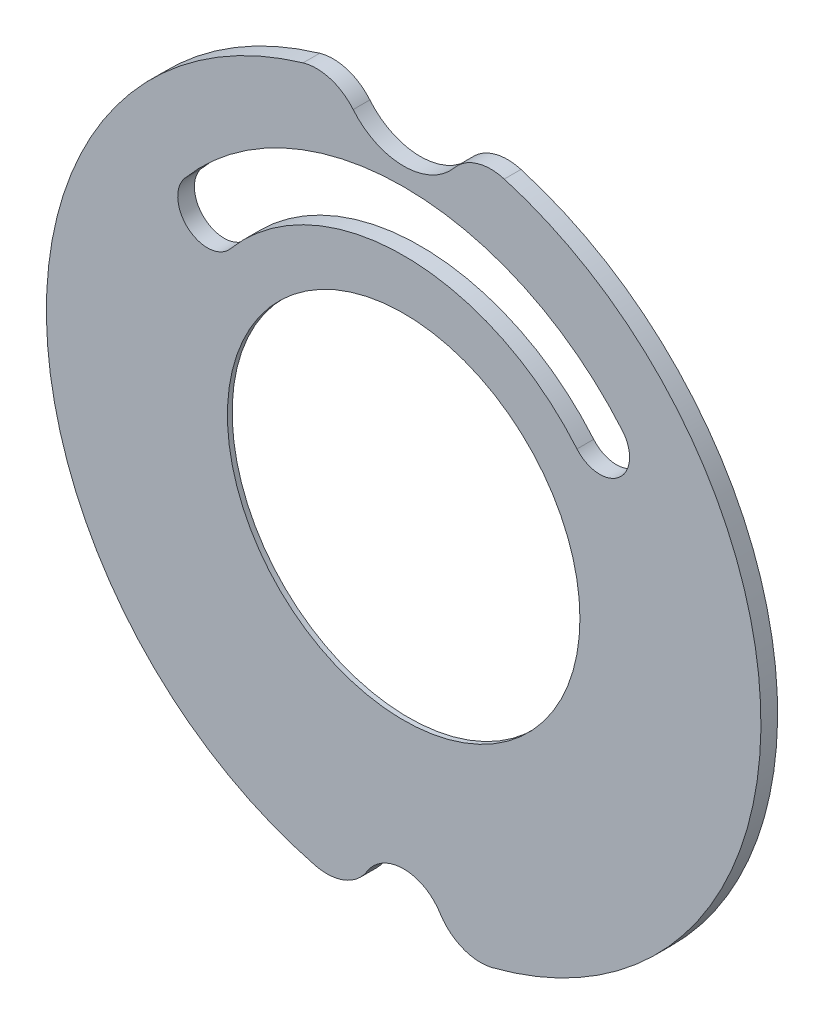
ISO-10303-21;
HEADER;
FILE_DESCRIPTION(('STEP AP214'),'2;1');
FILE_NAME('part.step','',(''),(''),'','','');
FILE_SCHEMA(('AUTOMOTIVE_DESIGN { 1 0 10303 214 1 1 1 1 }'));
ENDSEC;
DATA;
#1=APPLICATION_CONTEXT('core data for automotive mechanical design processes');
#2=APPLICATION_PROTOCOL_DEFINITION('international standard','automotive_design',2000,#1);
#3=PRODUCT_CONTEXT('',#1,'mechanical');
#4=PRODUCT('Part','Part','',(#3));
#5=PRODUCT_RELATED_PRODUCT_CATEGORY('part','',(#4));
#6=PRODUCT_DEFINITION_FORMATION('','',#4);
#7=PRODUCT_DEFINITION_CONTEXT('part definition',#1,'design');
#8=PRODUCT_DEFINITION('design','',#6,#7);
#9=PRODUCT_DEFINITION_SHAPE('','',#8);
#10=(LENGTH_UNIT() NAMED_UNIT(*) SI_UNIT(.MILLI.,.METRE.));
#11=(NAMED_UNIT(*) PLANE_ANGLE_UNIT() SI_UNIT($,.RADIAN.));
#12=(NAMED_UNIT(*) SI_UNIT($,.STERADIAN.) SOLID_ANGLE_UNIT());
#13=UNCERTAINTY_MEASURE_WITH_UNIT(LENGTH_MEASURE(1.E-05),#10,'distance_accuracy_value','');
#14=(GEOMETRIC_REPRESENTATION_CONTEXT(3) GLOBAL_UNCERTAINTY_ASSIGNED_CONTEXT((#13)) GLOBAL_UNIT_ASSIGNED_CONTEXT((#10,
#11,#12)) REPRESENTATION_CONTEXT('',''));
#15=CARTESIAN_POINT('',(0.,0.,0.));
#16=DIRECTION('',(0.,0.,1.));
#17=DIRECTION('',(1.,0.,0.));
#18=AXIS2_PLACEMENT_3D('',#15,#16,#17);
#19=CARTESIAN_POINT('',(0.,0.,0.));
#20=DIRECTION('',(0.,0.,1.));
#21=DIRECTION('',(1.,0.,0.));
#22=AXIS2_PLACEMENT_3D('',#19,#20,#21);
#23=PLANE('',#22);
#24=CARTESIAN_POINT('',(-82.3497776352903,69.0996680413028,0.));
#25=DIRECTION('',(0.,0.,1.));
#26=DIRECTION('',(1.,0.,0.));
#27=AXIS2_PLACEMENT_3D('',#24,#25,#26);
#28=CIRCLE('',#27,12.5);
#29=CARTESIAN_POINT('',(-91.9253331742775,77.1345131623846,0.));
#30=VERTEX_POINT('',#29);
#31=CARTESIAN_POINT('',(-72.774222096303,61.0648229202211,0.));
#32=VERTEX_POINT('',#31);
#33=EDGE_CURVE('E290',#30,#32,#28,.T.);
#34=ORIENTED_EDGE('',*,*,#33,.T.);
#35=CARTESIAN_POINT('',(0.,0.,0.));
#36=DIRECTION('',(0.,0.,-1.));
#37=DIRECTION('',(1.,0.,0.));
#38=AXIS2_PLACEMENT_3D('',#35,#36,#37);
#39=CIRCLE('',#38,95.);
#40=CARTESIAN_POINT('',(72.774222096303,61.0648229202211,0.));
#41=VERTEX_POINT('',#40);
#42=EDGE_CURVE('E293',#32,#41,#39,.T.);
#43=ORIENTED_EDGE('',*,*,#42,.T.);
#44=CARTESIAN_POINT('',(82.3497776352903,69.0996680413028,0.));
#45=DIRECTION('',(0.,0.,1.));
#46=DIRECTION('',(-1.,0.,0.));
#47=AXIS2_PLACEMENT_3D('',#44,#45,#46);
#48=CIRCLE('',#47,12.5);
#49=CARTESIAN_POINT('',(91.9253331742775,77.1345131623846,0.));
#50=VERTEX_POINT('',#49);
#51=EDGE_CURVE('E296',#41,#50,#48,.T.);
#52=ORIENTED_EDGE('',*,*,#51,.T.);
#53=CARTESIAN_POINT('',(0.,0.,0.));
#54=DIRECTION('',(0.,0.,1.));
#55=DIRECTION('',(1.,0.,0.));
#56=AXIS2_PLACEMENT_3D('',#53,#54,#55);
#57=CIRCLE('',#56,120.);
#58=EDGE_CURVE('E299',#50,#30,#57,.T.);
#59=ORIENTED_EDGE('',*,*,#58,.T.);
#60=EDGE_LOOP('',(#34,#43,#52,#59));
#61=FACE_BOUND('',#60,.T.);
#62=CARTESIAN_POINT('',(-82.3497776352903,69.0996680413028,0.));
#63=DIRECTION('',(0.,0.,1.));
#64=DIRECTION('',(1.,0.,0.));
#65=AXIS2_PLACEMENT_3D('',#62,#63,#64);
#66=CIRCLE('',#65,14.5);
#67=CARTESIAN_POINT('',(-93.4574220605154,78.4200883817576,0.));
#68=VERTEX_POINT('',#67);
#69=CARTESIAN_POINT('',(-71.242133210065,59.779247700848,0.));
#70=VERTEX_POINT('',#69);
#71=EDGE_CURVE('E259',#68,#70,#66,.T.);
#72=ORIENTED_EDGE('',*,*,#71,.F.);
#73=CARTESIAN_POINT('',(0.,0.,0.));
#74=DIRECTION('',(0.,0.,1.));
#75=DIRECTION('',(1.,0.,0.));
#76=AXIS2_PLACEMENT_3D('',#73,#74,#75);
#77=CIRCLE('',#76,122.);
#78=CARTESIAN_POINT('',(93.4574220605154,78.4200883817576,0.));
#79=VERTEX_POINT('',#78);
#80=EDGE_CURVE('E274',#79,#68,#77,.T.);
#81=ORIENTED_EDGE('',*,*,#80,.F.);
#82=CARTESIAN_POINT('',(82.3497776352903,69.0996680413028,0.));
#83=DIRECTION('',(0.,0.,1.));
#84=DIRECTION('',(1.,0.,0.));
#85=AXIS2_PLACEMENT_3D('',#82,#83,#84);
#86=CIRCLE('',#85,14.5);
#87=CARTESIAN_POINT('',(71.242133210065,59.779247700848,0.));
#88=VERTEX_POINT('',#87);
#89=EDGE_CURVE('E55',#88,#79,#86,.T.);
#90=ORIENTED_EDGE('',*,*,#89,.F.);
#91=CARTESIAN_POINT('',(0.,0.,0.));
#92=DIRECTION('',(0.,0.,1.));
#93=DIRECTION('',(1.,0.,0.));
#94=AXIS2_PLACEMENT_3D('',#91,#92,#93);
#95=CIRCLE('',#94,93.);
#96=EDGE_CURVE('E270',#70,#88,#95,.F.);
#97=ORIENTED_EDGE('',*,*,#96,.F.);
#98=EDGE_LOOP('',(#72,#81,#90,#97));
#99=FACE_BOUND('',#98,.T.);
#100=ADVANCED_FACE('F31',(#61,#99),#23,.F.);
#101=CARTESIAN_POINT('',(0.,0.,7.));
#102=DIRECTION('',(0.,0.,-1.));
#103=DIRECTION('',(-1.,0.,0.));
#104=AXIS2_PLACEMENT_3D('',#101,#102,#103);
#105=CYLINDRICAL_SURFACE('',#104,150.);
#106=CARTESIAN_POINT('',(0.,0.,0.));
#107=DIRECTION('',(0.,0.,1.));
#108=DIRECTION('',(1.,0.,0.));
#109=AXIS2_PLACEMENT_3D('',#106,#107,#108);
#110=CIRCLE('',#109,150.);
#111=CARTESIAN_POINT('',(-42.2448825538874,143.928349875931,0.));
#112=VERTEX_POINT('',#111);
#113=CARTESIAN_POINT('',(-37.232875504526,-145.305584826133,0.));
#114=VERTEX_POINT('',#113);
#115=EDGE_CURVE('E322',#112,#114,#110,.T.);
#116=ORIENTED_EDGE('',*,*,#115,.T.);
#117=DIRECTION('',(0.,0.,-1.));
#118=VECTOR('',#117,1.);
#119=CARTESIAN_POINT('',(-37.232875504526,-145.305584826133,7.));
#120=LINE('',#119,#118);
#121=CARTESIAN_POINT('',(-37.232875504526,-145.305584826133,7.));
#122=VERTEX_POINT('',#121);
#123=EDGE_CURVE('E11',#114,#122,#120,.F.);
#124=ORIENTED_EDGE('',*,*,#123,.T.);
#125=CARTESIAN_POINT('',(0.,0.,7.));
#126=DIRECTION('',(0.,0.,1.));
#127=DIRECTION('',(1.,0.,0.));
#128=AXIS2_PLACEMENT_3D('',#125,#126,#127);
#129=CIRCLE('',#128,150.);
#130=CARTESIAN_POINT('',(-42.2448825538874,143.928349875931,7.));
#131=VERTEX_POINT('',#130);
#132=EDGE_CURVE('E326',#131,#122,#129,.T.);
#133=ORIENTED_EDGE('',*,*,#132,.F.);
#134=DIRECTION('',(0.,0.,-1.));
#135=VECTOR('',#134,1.);
#136=CARTESIAN_POINT('',(-42.2448825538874,143.928349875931,7.));
#137=LINE('',#136,#135);
#138=EDGE_CURVE('E332',#131,#112,#137,.T.);
#139=ORIENTED_EDGE('',*,*,#138,.T.);
#140=EDGE_LOOP('',(#116,#124,#133,#139));
#141=FACE_BOUND('',#140,.T.);
#142=ADVANCED_FACE('F387',(#141),#105,.T.);
#143=CARTESIAN_POINT('',(0.,0.,7.));
#144=DIRECTION('',(0.,0.,1.));
#145=DIRECTION('',(1.,0.,0.));
#146=AXIS2_PLACEMENT_3D('',#143,#144,#145);
#147=PLANE('',#146);
#148=CARTESIAN_POINT('',(0.,0.,7.));
#149=DIRECTION('',(0.,0.,1.));
#150=DIRECTION('',(1.,0.,0.));
#151=AXIS2_PLACEMENT_3D('',#148,#149,#150);
#152=CIRCLE('',#151,74.);
#153=CARTESIAN_POINT('',(74.,0.,7.));
#154=VERTEX_POINT('',#153);
#155=EDGE_CURVE('E434',#154,#154,#152,.T.);
#156=ORIENTED_EDGE('',*,*,#155,.F.);
#157=EDGE_LOOP('',(#156));
#158=FACE_BOUND('',#157,.T.);
#159=CARTESIAN_POINT('',(0.,-146.,6.99999999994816));
#160=DIRECTION('',(0.,0.,1.));
#161=DIRECTION('',(1.,0.,0.));
#162=AXIS2_PLACEMENT_3D('',#159,#160,#161);
#163=CIRCLE('',#162,18.);
#164=CARTESIAN_POINT('',(15.2850752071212,-136.493871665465,6.99999999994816));
#165=VERTEX_POINT('',#164);
#166=CARTESIAN_POINT('',(-15.2850752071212,-136.493871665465,6.99999999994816));
#167=VERTEX_POINT('',#166);
#168=EDGE_CURVE('E278',#165,#167,#163,.T.);
#169=ORIENTED_EDGE('',*,*,#168,.F.);
#170=CARTESIAN_POINT('',(32.2684921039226,-125.931506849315,7.));
#171=DIRECTION('',(0.,0.,1.));
#172=DIRECTION('',(1.,0.,0.));
#173=AXIS2_PLACEMENT_3D('',#170,#171,#172);
#174=CIRCLE('',#173,20.);
#175=CARTESIAN_POINT('',(37.232875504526,-145.305584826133,7.));
#176=VERTEX_POINT('',#175);
#177=EDGE_CURVE('E40',#165,#176,#174,.T.);
#178=ORIENTED_EDGE('',*,*,#177,.T.);
#179=CARTESIAN_POINT('',(42.2448825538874,143.928349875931,7.));
#180=VERTEX_POINT('',#179);
#181=EDGE_CURVE('E325',#176,#180,#129,.T.);
#182=ORIENTED_EDGE('',*,*,#181,.T.);
#183=CARTESIAN_POINT('',(36.6122315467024,124.737903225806,7.));
#184=DIRECTION('',(0.,0.,1.));
#185=DIRECTION('',(1.,0.,0.));
#186=AXIS2_PLACEMENT_3D('',#183,#184,#185);
#187=CIRCLE('',#186,20.);
#188=CARTESIAN_POINT('',(21.1965551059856,137.479838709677,7.000000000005));
#189=VERTEX_POINT('',#188);
#190=EDGE_CURVE('E344',#180,#189,#187,.T.);
#191=ORIENTED_EDGE('',*,*,#190,.T.);
#192=CARTESIAN_POINT('',(0.,155.,7.000000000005));
#193=DIRECTION('',(0.,0.,1.));
#194=DIRECTION('',(1.,0.,0.));
#195=AXIS2_PLACEMENT_3D('',#192,#193,#194);
#196=CIRCLE('',#195,27.5);
#197=CARTESIAN_POINT('',(-21.1965551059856,137.479838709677,7.000000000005));
#198=VERTEX_POINT('',#197);
#199=EDGE_CURVE('E284',#198,#189,#196,.T.);
#200=ORIENTED_EDGE('',*,*,#199,.F.);
#201=CARTESIAN_POINT('',(-36.6122315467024,124.737903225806,7.));
#202=DIRECTION('',(0.,0.,1.));
#203=DIRECTION('',(1.,0.,0.));
#204=AXIS2_PLACEMENT_3D('',#201,#202,#203);
#205=CIRCLE('',#204,20.);
#206=EDGE_CURVE('E346',#198,#131,#205,.T.);
#207=ORIENTED_EDGE('',*,*,#206,.T.);
#208=ORIENTED_EDGE('',*,*,#132,.T.);
#209=CARTESIAN_POINT('',(-32.2684921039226,-125.931506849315,7.));
#210=DIRECTION('',(0.,0.,1.));
#211=DIRECTION('',(1.,0.,0.));
#212=AXIS2_PLACEMENT_3D('',#209,#210,#211);
#213=CIRCLE('',#212,20.);
#214=EDGE_CURVE('E359',#122,#167,#213,.T.);
#215=ORIENTED_EDGE('',*,*,#214,.T.);
#216=EDGE_LOOP('',(#169,#178,#182,#191,#200,#207,#208,#215));
#217=FACE_BOUND('',#216,.T.);
#218=CARTESIAN_POINT('',(0.,0.,7.));
#219=DIRECTION('',(0.,0.,-1.));
#220=DIRECTION('',(1.,0.,0.));
#221=AXIS2_PLACEMENT_3D('',#218,#219,#220);
#222=CIRCLE('',#221,95.);
#223=CARTESIAN_POINT('',(-72.774222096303,61.0648229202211,7.));
#224=VERTEX_POINT('',#223);
#225=CARTESIAN_POINT('',(72.774222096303,61.0648229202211,7.));
#226=VERTEX_POINT('',#225);
#227=EDGE_CURVE('E304',#224,#226,#222,.T.);
#228=ORIENTED_EDGE('',*,*,#227,.F.);
#229=CARTESIAN_POINT('',(-82.3497776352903,69.0996680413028,7.));
#230=DIRECTION('',(0.,0.,1.));
#231=DIRECTION('',(1.,0.,0.));
#232=AXIS2_PLACEMENT_3D('',#229,#230,#231);
#233=CIRCLE('',#232,12.5);
#234=CARTESIAN_POINT('',(-91.9253331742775,77.1345131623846,7.));
#235=VERTEX_POINT('',#234);
#236=EDGE_CURVE('E302',#235,#224,#233,.T.);
#237=ORIENTED_EDGE('',*,*,#236,.F.);
#238=CARTESIAN_POINT('',(0.,0.,7.));
#239=DIRECTION('',(0.,0.,1.));
#240=DIRECTION('',(1.,0.,0.));
#241=AXIS2_PLACEMENT_3D('',#238,#239,#240);
#242=CIRCLE('',#241,120.);
#243=CARTESIAN_POINT('',(91.9253331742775,77.1345131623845,7.));
#244=VERTEX_POINT('',#243);
#245=EDGE_CURVE('E309',#244,#235,#242,.T.);
#246=ORIENTED_EDGE('',*,*,#245,.F.);
#247=CARTESIAN_POINT('',(82.3497776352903,69.0996680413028,7.));
#248=DIRECTION('',(0.,0.,1.));
#249=DIRECTION('',(-1.,0.,0.));
#250=AXIS2_PLACEMENT_3D('',#247,#248,#249);
#251=CIRCLE('',#250,12.5);
#252=EDGE_CURVE('E306',#226,#244,#251,.T.);
#253=ORIENTED_EDGE('',*,*,#252,.F.);
#254=EDGE_LOOP('',(#228,#237,#246,#253));
#255=FACE_BOUND('',#254,.T.);
#256=ADVANCED_FACE('F365',(#158,#217,#255),#147,.T.);
#257=CARTESIAN_POINT('',(32.2684921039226,-125.931506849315,0.));
#258=DIRECTION('',(0.,0.,1.));
#259=DIRECTION('',(1.,0.,0.));
#260=AXIS2_PLACEMENT_3D('',#257,#258,#259);
#261=CIRCLE('',#260,18.);
#262=CARTESIAN_POINT('',(36.7364371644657,-143.368177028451,0.));
#263=VERTEX_POINT('',#262);
#264=CARTESIAN_POINT('',(16.9834168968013,-135.43763518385,0.));
#265=VERTEX_POINT('',#264);
#266=EDGE_CURVE('E227',#263,#265,#261,.F.);
#267=ORIENTED_EDGE('',*,*,#266,.F.);
#268=CARTESIAN_POINT('',(0.,0.,0.));
#269=DIRECTION('',(0.,0.,1.));
#270=DIRECTION('',(1.,0.,0.));
#271=AXIS2_PLACEMENT_3D('',#268,#269,#270);
#272=CIRCLE('',#271,148.);
#273=CARTESIAN_POINT('',(41.6816174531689,142.009305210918,0.));
#274=VERTEX_POINT('',#273);
#275=EDGE_CURVE('E222',#263,#274,#272,.T.);
#276=ORIENTED_EDGE('',*,*,#275,.T.);
#277=CARTESIAN_POINT('',(36.6122315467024,124.737903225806,0.));
#278=DIRECTION('',(0.,0.,1.));
#279=DIRECTION('',(1.,0.,0.));
#280=AXIS2_PLACEMENT_3D('',#277,#278,#279);
#281=CIRCLE('',#280,18.);
#282=CARTESIAN_POINT('',(22.7381227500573,136.20564516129,0.));
#283=VERTEX_POINT('',#282);
#284=EDGE_CURVE('E257',#283,#274,#281,.F.);
#285=ORIENTED_EDGE('',*,*,#284,.F.);
#286=CARTESIAN_POINT('',(0.,155.,0.));
#287=DIRECTION('',(0.,0.,1.));
#288=DIRECTION('',(1.,0.,0.));
#289=AXIS2_PLACEMENT_3D('',#286,#287,#288);
#290=CIRCLE('',#289,29.5);
#291=CARTESIAN_POINT('',(-22.7381227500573,136.20564516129,0.));
#292=VERTEX_POINT('',#291);
#293=EDGE_CURVE('E47',#292,#283,#290,.T.);
#294=ORIENTED_EDGE('',*,*,#293,.F.);
#295=CARTESIAN_POINT('',(-36.6122315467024,124.737903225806,0.));
#296=DIRECTION('',(0.,0.,1.));
#297=DIRECTION('',(1.,0.,0.));
#298=AXIS2_PLACEMENT_3D('',#295,#296,#297);
#299=CIRCLE('',#298,18.);
#300=CARTESIAN_POINT('',(-41.6816174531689,142.009305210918,0.));
#301=VERTEX_POINT('',#300);
#302=EDGE_CURVE('E240',#301,#292,#299,.F.);
#303=ORIENTED_EDGE('',*,*,#302,.F.);
#304=CARTESIAN_POINT('',(0.,0.,0.));
#305=DIRECTION('',(0.,0.,1.));
#306=DIRECTION('',(1.,0.,0.));
#307=AXIS2_PLACEMENT_3D('',#304,#305,#306);
#308=CIRCLE('',#307,148.);
#309=CARTESIAN_POINT('',(-36.7364371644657,-143.368177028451,0.));
#310=VERTEX_POINT('',#309);
#311=EDGE_CURVE('E218',#301,#310,#308,.T.);
#312=ORIENTED_EDGE('',*,*,#311,.T.);
#313=CARTESIAN_POINT('',(-32.2684921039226,-125.931506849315,0.));
#314=DIRECTION('',(0.,0.,1.));
#315=DIRECTION('',(1.,0.,0.));
#316=AXIS2_PLACEMENT_3D('',#313,#314,#315);
#317=CIRCLE('',#316,18.);
#318=CARTESIAN_POINT('',(-16.9834168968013,-135.43763518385,0.));
#319=VERTEX_POINT('',#318);
#320=EDGE_CURVE('E224',#319,#310,#317,.F.);
#321=ORIENTED_EDGE('',*,*,#320,.F.);
#322=CARTESIAN_POINT('',(0.,-146.,0.));
#323=DIRECTION('',(0.,0.,1.));
#324=DIRECTION('',(1.,0.,0.));
#325=AXIS2_PLACEMENT_3D('',#322,#323,#324);
#326=CIRCLE('',#325,20.);
#327=EDGE_CURVE('E264',#265,#319,#326,.T.);
#328=ORIENTED_EDGE('',*,*,#327,.F.);
#329=EDGE_LOOP('',(#267,#276,#285,#294,#303,#312,#321,#328));
#330=FACE_BOUND('',#329,.T.);
#331=CARTESIAN_POINT('',(37.232875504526,-145.305584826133,0.));
#332=VERTEX_POINT('',#331);
#333=CARTESIAN_POINT('',(42.2448825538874,143.928349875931,0.));
#334=VERTEX_POINT('',#333);
#335=EDGE_CURVE('E321',#332,#334,#110,.T.);
#336=ORIENTED_EDGE('',*,*,#335,.F.);
#337=CARTESIAN_POINT('',(32.2684921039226,-125.931506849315,0.));
#338=DIRECTION('',(0.,0.,1.));
#339=DIRECTION('',(1.,0.,0.));
#340=AXIS2_PLACEMENT_3D('',#337,#338,#339);
#341=CIRCLE('',#340,20.);
#342=CARTESIAN_POINT('',(15.2850752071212,-136.493871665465,0.));
#343=VERTEX_POINT('',#342);
#344=EDGE_CURVE('E353',#332,#343,#341,.F.);
#345=ORIENTED_EDGE('',*,*,#344,.T.);
#346=CARTESIAN_POINT('',(0.,-146.,0.));
#347=DIRECTION('',(0.,0.,1.));
#348=DIRECTION('',(1.,0.,0.));
#349=AXIS2_PLACEMENT_3D('',#346,#347,#348);
#350=CIRCLE('',#349,18.);
#351=CARTESIAN_POINT('',(-15.2850752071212,-136.493871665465,0.));
#352=VERTEX_POINT('',#351);
#353=EDGE_CURVE('E281',#343,#352,#350,.T.);
#354=ORIENTED_EDGE('',*,*,#353,.T.);
#355=CARTESIAN_POINT('',(-32.2684921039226,-125.931506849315,0.));
#356=DIRECTION('',(0.,0.,1.));
#357=DIRECTION('',(1.,0.,0.));
#358=AXIS2_PLACEMENT_3D('',#355,#356,#357);
#359=CIRCLE('',#358,20.);
#360=EDGE_CURVE('E351',#352,#114,#359,.F.);
#361=ORIENTED_EDGE('',*,*,#360,.T.);
#362=ORIENTED_EDGE('',*,*,#115,.F.);
#363=CARTESIAN_POINT('',(-36.6122315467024,124.737903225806,0.));
#364=DIRECTION('',(0.,0.,1.));
#365=DIRECTION('',(1.,0.,0.));
#366=AXIS2_PLACEMENT_3D('',#363,#364,#365);
#367=CIRCLE('',#366,20.);
#368=CARTESIAN_POINT('',(-21.1965551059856,137.479838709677,0.));
#369=VERTEX_POINT('',#368);
#370=EDGE_CURVE('E338',#112,#369,#367,.F.);
#371=ORIENTED_EDGE('',*,*,#370,.T.);
#372=CARTESIAN_POINT('',(0.,155.,0.));
#373=DIRECTION('',(0.,0.,1.));
#374=DIRECTION('',(1.,0.,0.));
#375=AXIS2_PLACEMENT_3D('',#372,#373,#374);
#376=CIRCLE('',#375,27.5);
#377=CARTESIAN_POINT('',(21.1965551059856,137.479838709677,0.));
#378=VERTEX_POINT('',#377);
#379=EDGE_CURVE('E287',#369,#378,#376,.T.);
#380=ORIENTED_EDGE('',*,*,#379,.T.);
#381=CARTESIAN_POINT('',(36.6122315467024,124.737903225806,0.));
#382=DIRECTION('',(0.,0.,1.));
#383=DIRECTION('',(1.,0.,0.));
#384=AXIS2_PLACEMENT_3D('',#381,#382,#383);
#385=CIRCLE('',#384,20.);
#386=EDGE_CURVE('E335',#378,#334,#385,.F.);
#387=ORIENTED_EDGE('',*,*,#386,.T.);
#388=EDGE_LOOP('',(#336,#345,#354,#361,#362,#371,#380,#387));
#389=FACE_BOUND('',#388,.T.);
#390=ADVANCED_FACE('F377',(#330,#389),#23,.F.);
#391=ORIENTED_EDGE('',*,*,#181,.F.);
#392=DIRECTION('',(0.,0.,-1.));
#393=VECTOR('',#392,1.);
#394=CARTESIAN_POINT('',(37.232875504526,-145.305584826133,7.));
#395=LINE('',#394,#393);
#396=EDGE_CURVE('E348',#176,#332,#395,.T.);
#397=ORIENTED_EDGE('',*,*,#396,.T.);
#398=ORIENTED_EDGE('',*,*,#335,.T.);
#399=DIRECTION('',(0.,0.,-1.));
#400=VECTOR('',#399,1.);
#401=CARTESIAN_POINT('',(42.2448825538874,143.928349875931,7.));
#402=LINE('',#401,#400);
#403=EDGE_CURVE('E329',#334,#180,#402,.F.);
#404=ORIENTED_EDGE('',*,*,#403,.T.);
#405=EDGE_LOOP('',(#391,#397,#398,#404));
#406=FACE_BOUND('',#405,.T.);
#407=ADVANCED_FACE('F33',(#406),#105,.T.);
#408=CARTESIAN_POINT('',(-82.3497776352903,69.0996680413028,7.));
#409=DIRECTION('',(0.,0.,-1.));
#410=DIRECTION('',(-1.,0.,0.));
#411=AXIS2_PLACEMENT_3D('',#408,#409,#410);
#412=CYLINDRICAL_SURFACE('',#411,12.5);
#413=ORIENTED_EDGE('',*,*,#33,.F.);
#414=DIRECTION('',(0.,0.,-1.));
#415=VECTOR('',#414,1.);
#416=CARTESIAN_POINT('',(-91.9253331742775,77.1345131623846,7.));
#417=LINE('',#416,#415);
#418=EDGE_CURVE('E311',#235,#30,#417,.T.);
#419=ORIENTED_EDGE('',*,*,#418,.F.);
#420=ORIENTED_EDGE('',*,*,#236,.T.);
#421=DIRECTION('',(0.,0.,-1.));
#422=VECTOR('',#421,1.);
#423=CARTESIAN_POINT('',(-72.774222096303,61.0648229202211,7.));
#424=LINE('',#423,#422);
#425=EDGE_CURVE('E318',#224,#32,#424,.T.);
#426=ORIENTED_EDGE('',*,*,#425,.T.);
#427=EDGE_LOOP('',(#413,#419,#420,#426));
#428=FACE_BOUND('',#427,.T.);
#429=ADVANCED_FACE('F424',(#428),#412,.F.);
#430=CARTESIAN_POINT('',(0.,0.,7.));
#431=DIRECTION('',(0.,0.,-1.));
#432=DIRECTION('',(-1.,0.,0.));
#433=AXIS2_PLACEMENT_3D('',#430,#431,#432);
#434=CYLINDRICAL_SURFACE('',#433,95.);
#435=ORIENTED_EDGE('',*,*,#42,.F.);
#436=ORIENTED_EDGE('',*,*,#425,.F.);
#437=ORIENTED_EDGE('',*,*,#227,.T.);
#438=DIRECTION('',(0.,0.,-1.));
#439=VECTOR('',#438,1.);
#440=CARTESIAN_POINT('',(72.774222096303,61.0648229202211,7.));
#441=LINE('',#440,#439);
#442=EDGE_CURVE('E316',#226,#41,#441,.T.);
#443=ORIENTED_EDGE('',*,*,#442,.T.);
#444=EDGE_LOOP('',(#435,#436,#437,#443));
#445=FACE_BOUND('',#444,.T.);
#446=ADVANCED_FACE('F634',(#445),#434,.T.);
#447=CARTESIAN_POINT('',(82.3497776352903,69.0996680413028,7.));
#448=DIRECTION('',(0.,0.,-1.));
#449=DIRECTION('',(-1.,0.,0.));
#450=AXIS2_PLACEMENT_3D('',#447,#448,#449);
#451=CYLINDRICAL_SURFACE('',#450,12.5);
#452=ORIENTED_EDGE('',*,*,#51,.F.);
#453=ORIENTED_EDGE('',*,*,#442,.F.);
#454=ORIENTED_EDGE('',*,*,#252,.T.);
#455=DIRECTION('',(0.,0.,-1.));
#456=VECTOR('',#455,1.);
#457=CARTESIAN_POINT('',(91.9253331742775,77.1345131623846,7.));
#458=LINE('',#457,#456);
#459=EDGE_CURVE('E314',#244,#50,#458,.T.);
#460=ORIENTED_EDGE('',*,*,#459,.T.);
#461=EDGE_LOOP('',(#452,#453,#454,#460));
#462=FACE_BOUND('',#461,.T.);
#463=ADVANCED_FACE('F640',(#462),#451,.F.);
#464=CARTESIAN_POINT('',(0.,0.,7.));
#465=DIRECTION('',(0.,0.,-1.));
#466=DIRECTION('',(-1.,0.,0.));
#467=AXIS2_PLACEMENT_3D('',#464,#465,#466);
#468=CYLINDRICAL_SURFACE('',#467,120.);
#469=ORIENTED_EDGE('',*,*,#58,.F.);
#470=ORIENTED_EDGE('',*,*,#459,.F.);
#471=ORIENTED_EDGE('',*,*,#245,.T.);
#472=ORIENTED_EDGE('',*,*,#418,.T.);
#473=EDGE_LOOP('',(#469,#470,#471,#472));
#474=FACE_BOUND('',#473,.T.);
#475=ADVANCED_FACE('F648',(#474),#468,.F.);
#476=CARTESIAN_POINT('',(0.,155.,0.));
#477=DIRECTION('',(0.,0.,1.));
#478=DIRECTION('',(1.,0.,0.));
#479=AXIS2_PLACEMENT_3D('',#476,#477,#478);
#480=CYLINDRICAL_SURFACE('',#479,27.5);
#481=ORIENTED_EDGE('',*,*,#379,.F.);
#482=DIRECTION('',(0.,0.,1.));
#483=VECTOR('',#482,1.);
#484=CARTESIAN_POINT('',(-21.1965551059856,137.479838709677,0.));
#485=LINE('',#484,#483);
#486=EDGE_CURVE('E342',#369,#198,#485,.T.);
#487=ORIENTED_EDGE('',*,*,#486,.T.);
#488=ORIENTED_EDGE('',*,*,#199,.T.);
#489=DIRECTION('',(0.,0.,1.));
#490=VECTOR('',#489,1.);
#491=CARTESIAN_POINT('',(21.1965551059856,137.479838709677,0.));
#492=LINE('',#491,#490);
#493=EDGE_CURVE('E340',#189,#378,#492,.F.);
#494=ORIENTED_EDGE('',*,*,#493,.T.);
#495=EDGE_LOOP('',(#481,#487,#488,#494));
#496=FACE_BOUND('',#495,.T.);
#497=ADVANCED_FACE('F397',(#496),#480,.F.);
#498=CARTESIAN_POINT('',(-36.6122315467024,124.737903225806,0.));
#499=DIRECTION('',(0.,0.,1.));
#500=DIRECTION('',(1.,0.,0.));
#501=AXIS2_PLACEMENT_3D('',#498,#499,#500);
#502=CYLINDRICAL_SURFACE('',#501,20.);
#503=ORIENTED_EDGE('',*,*,#206,.F.);
#504=ORIENTED_EDGE('',*,*,#486,.F.);
#505=ORIENTED_EDGE('',*,*,#370,.F.);
#506=ORIENTED_EDGE('',*,*,#138,.F.);
#507=EDGE_LOOP('',(#503,#504,#505,#506));
#508=FACE_BOUND('',#507,.T.);
#509=ADVANCED_FACE('F392',(#508),#502,.T.);
#510=CARTESIAN_POINT('',(36.6122315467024,124.737903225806,0.));
#511=DIRECTION('',(0.,0.,-1.));
#512=DIRECTION('',(-1.,0.,0.));
#513=AXIS2_PLACEMENT_3D('',#510,#511,#512);
#514=CYLINDRICAL_SURFACE('',#513,20.);
#515=ORIENTED_EDGE('',*,*,#386,.F.);
#516=ORIENTED_EDGE('',*,*,#493,.F.);
#517=ORIENTED_EDGE('',*,*,#190,.F.);
#518=ORIENTED_EDGE('',*,*,#403,.F.);
#519=EDGE_LOOP('',(#515,#516,#517,#518));
#520=FACE_BOUND('',#519,.T.);
#521=ADVANCED_FACE('F401',(#520),#514,.T.);
#522=CARTESIAN_POINT('',(0.,-146.,0.));
#523=DIRECTION('',(0.,0.,1.));
#524=DIRECTION('',(1.,0.,0.));
#525=AXIS2_PLACEMENT_3D('',#522,#523,#524);
#526=CYLINDRICAL_SURFACE('',#525,18.);
#527=ORIENTED_EDGE('',*,*,#353,.F.);
#528=DIRECTION('',(0.,0.,1.));
#529=VECTOR('',#528,1.);
#530=CARTESIAN_POINT('',(15.2850752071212,-136.493871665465,0.));
#531=LINE('',#530,#529);
#532=EDGE_CURVE('E357',#343,#165,#531,.T.);
#533=ORIENTED_EDGE('',*,*,#532,.T.);
#534=ORIENTED_EDGE('',*,*,#168,.T.);
#535=DIRECTION('',(0.,0.,1.));
#536=VECTOR('',#535,1.);
#537=CARTESIAN_POINT('',(-15.2850752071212,-136.493871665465,0.));
#538=LINE('',#537,#536);
#539=EDGE_CURVE('E355',#167,#352,#538,.F.);
#540=ORIENTED_EDGE('',*,*,#539,.T.);
#541=EDGE_LOOP('',(#527,#533,#534,#540));
#542=FACE_BOUND('',#541,.T.);
#543=ADVANCED_FACE('F380',(#542),#526,.F.);
#544=CARTESIAN_POINT('',(32.2684921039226,-125.931506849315,0.));
#545=DIRECTION('',(0.,0.,1.));
#546=DIRECTION('',(1.,0.,0.));
#547=AXIS2_PLACEMENT_3D('',#544,#545,#546);
#548=CYLINDRICAL_SURFACE('',#547,20.);
#549=ORIENTED_EDGE('',*,*,#177,.F.);
#550=ORIENTED_EDGE('',*,*,#532,.F.);
#551=ORIENTED_EDGE('',*,*,#344,.F.);
#552=ORIENTED_EDGE('',*,*,#396,.F.);
#553=EDGE_LOOP('',(#549,#550,#551,#552));
#554=FACE_BOUND('',#553,.T.);
#555=ADVANCED_FACE('F374',(#554),#548,.T.);
#556=CARTESIAN_POINT('',(-32.2684921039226,-125.931506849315,0.));
#557=DIRECTION('',(0.,0.,-1.));
#558=DIRECTION('',(-1.,0.,0.));
#559=AXIS2_PLACEMENT_3D('',#556,#557,#558);
#560=CYLINDRICAL_SURFACE('',#559,20.);
#561=ORIENTED_EDGE('',*,*,#360,.F.);
#562=ORIENTED_EDGE('',*,*,#539,.F.);
#563=ORIENTED_EDGE('',*,*,#214,.F.);
#564=ORIENTED_EDGE('',*,*,#123,.F.);
#565=EDGE_LOOP('',(#561,#562,#563,#564));
#566=FACE_BOUND('',#565,.T.);
#567=ADVANCED_FACE('F383',(#566),#560,.T.);
#568=CARTESIAN_POINT('',(0.,0.,7.));
#569=DIRECTION('',(0.,0.,-1.));
#570=DIRECTION('',(-1.,0.,0.));
#571=AXIS2_PLACEMENT_3D('',#568,#569,#570);
#572=CYLINDRICAL_SURFACE('',#571,148.);
#573=ORIENTED_EDGE('',*,*,#311,.F.);
#574=DIRECTION('',(0.,0.,-1.));
#575=VECTOR('',#574,1.);
#576=CARTESIAN_POINT('',(-41.6816174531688,142.009305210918,7.));
#577=LINE('',#576,#575);
#578=CARTESIAN_POINT('',(-41.6816174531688,142.009305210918,5.));
#579=VERTEX_POINT('',#578);
#580=EDGE_CURVE('E236',#579,#301,#577,.T.);
#581=ORIENTED_EDGE('',*,*,#580,.F.);
#582=CARTESIAN_POINT('',(0.,0.,5.));
#583=DIRECTION('',(0.,0.,1.));
#584=DIRECTION('',(1.,0.,0.));
#585=AXIS2_PLACEMENT_3D('',#582,#583,#584);
#586=CIRCLE('',#585,148.);
#587=CARTESIAN_POINT('',(-36.7364371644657,-143.368177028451,5.));
#588=VERTEX_POINT('',#587);
#589=EDGE_CURVE('E217',#579,#588,#586,.T.);
#590=ORIENTED_EDGE('',*,*,#589,.T.);
#591=DIRECTION('',(0.,0.,-1.));
#592=VECTOR('',#591,1.);
#593=CARTESIAN_POINT('',(-36.7364371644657,-143.368177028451,7.));
#594=LINE('',#593,#592);
#595=EDGE_CURVE('E205',#310,#588,#594,.F.);
#596=ORIENTED_EDGE('',*,*,#595,.F.);
#597=EDGE_LOOP('',(#573,#581,#590,#596));
#598=FACE_BOUND('',#597,.T.);
#599=ADVANCED_FACE('F493',(#598),#572,.F.);
#600=CARTESIAN_POINT('',(0.,0.,5.));
#601=DIRECTION('',(0.,0.,1.));
#602=DIRECTION('',(1.,0.,0.));
#603=AXIS2_PLACEMENT_3D('',#600,#601,#602);
#604=PLANE('',#603);
#605=CARTESIAN_POINT('',(0.,0.,5.));
#606=DIRECTION('',(0.,0.,1.));
#607=DIRECTION('',(1.,0.,0.));
#608=AXIS2_PLACEMENT_3D('',#605,#606,#607);
#609=CIRCLE('',#608,74.);
#610=CARTESIAN_POINT('',(74.,0.,5.));
#611=VERTEX_POINT('',#610);
#612=EDGE_CURVE('E35',#611,#611,#609,.T.);
#613=ORIENTED_EDGE('',*,*,#612,.T.);
#614=EDGE_LOOP('',(#613));
#615=FACE_BOUND('',#614,.T.);
#616=CARTESIAN_POINT('',(0.,-146.,5.));
#617=DIRECTION('',(0.,0.,1.));
#618=DIRECTION('',(1.,0.,0.));
#619=AXIS2_PLACEMENT_3D('',#616,#617,#618);
#620=CIRCLE('',#619,20.);
#621=CARTESIAN_POINT('',(16.9834168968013,-135.43763518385,5.));
#622=VERTEX_POINT('',#621);
#623=CARTESIAN_POINT('',(-16.9834168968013,-135.43763518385,5.));
#624=VERTEX_POINT('',#623);
#625=EDGE_CURVE('E266',#622,#624,#620,.T.);
#626=ORIENTED_EDGE('',*,*,#625,.T.);
#627=CARTESIAN_POINT('',(-32.2684921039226,-125.931506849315,5.));
#628=DIRECTION('',(0.,0.,1.));
#629=DIRECTION('',(1.,0.,0.));
#630=AXIS2_PLACEMENT_3D('',#627,#628,#629);
#631=CIRCLE('',#630,18.);
#632=EDGE_CURVE('E206',#588,#624,#631,.T.);
#633=ORIENTED_EDGE('',*,*,#632,.F.);
#634=ORIENTED_EDGE('',*,*,#589,.F.);
#635=CARTESIAN_POINT('',(-36.6122315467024,124.737903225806,5.));
#636=DIRECTION('',(0.,0.,1.));
#637=DIRECTION('',(1.,0.,0.));
#638=AXIS2_PLACEMENT_3D('',#635,#636,#637);
#639=CIRCLE('',#638,18.);
#640=CARTESIAN_POINT('',(-22.7381227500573,136.20564516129,5.));
#641=VERTEX_POINT('',#640);
#642=EDGE_CURVE('E225',#641,#579,#639,.T.);
#643=ORIENTED_EDGE('',*,*,#642,.F.);
#644=CARTESIAN_POINT('',(0.,155.,5.));
#645=DIRECTION('',(0.,0.,1.));
#646=DIRECTION('',(1.,0.,0.));
#647=AXIS2_PLACEMENT_3D('',#644,#645,#646);
#648=CIRCLE('',#647,29.5);
#649=CARTESIAN_POINT('',(22.7381227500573,136.20564516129,5.));
#650=VERTEX_POINT('',#649);
#651=EDGE_CURVE('E260',#641,#650,#648,.T.);
#652=ORIENTED_EDGE('',*,*,#651,.T.);
#653=CARTESIAN_POINT('',(36.6122315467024,124.737903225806,5.));
#654=DIRECTION('',(0.,0.,1.));
#655=DIRECTION('',(1.,0.,0.));
#656=AXIS2_PLACEMENT_3D('',#653,#654,#655);
#657=CIRCLE('',#656,18.);
#658=CARTESIAN_POINT('',(41.6816174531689,142.009305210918,5.));
#659=VERTEX_POINT('',#658);
#660=EDGE_CURVE('E213',#659,#650,#657,.T.);
#661=ORIENTED_EDGE('',*,*,#660,.F.);
#662=CARTESIAN_POINT('',(0.,0.,5.));
#663=DIRECTION('',(0.,0.,1.));
#664=DIRECTION('',(1.,0.,0.));
#665=AXIS2_PLACEMENT_3D('',#662,#663,#664);
#666=CIRCLE('',#665,148.);
#667=CARTESIAN_POINT('',(36.7364371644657,-143.368177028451,5.));
#668=VERTEX_POINT('',#667);
#669=EDGE_CURVE('E209',#668,#659,#666,.T.);
#670=ORIENTED_EDGE('',*,*,#669,.F.);
#671=CARTESIAN_POINT('',(32.2684921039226,-125.931506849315,5.));
#672=DIRECTION('',(0.,0.,1.));
#673=DIRECTION('',(1.,0.,0.));
#674=AXIS2_PLACEMENT_3D('',#671,#672,#673);
#675=CIRCLE('',#674,18.);
#676=EDGE_CURVE('E194',#622,#668,#675,.T.);
#677=ORIENTED_EDGE('',*,*,#676,.F.);
#678=EDGE_LOOP('',(#626,#633,#634,#643,#652,#661,#670,#677));
#679=FACE_BOUND('',#678,.T.);
#680=CARTESIAN_POINT('',(0.,0.,5.));
#681=DIRECTION('',(0.,0.,1.));
#682=DIRECTION('',(1.,0.,0.));
#683=AXIS2_PLACEMENT_3D('',#680,#681,#682);
#684=CIRCLE('',#683,93.);
#685=CARTESIAN_POINT('',(-71.242133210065,59.7792477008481,5.));
#686=VERTEX_POINT('',#685);
#687=CARTESIAN_POINT('',(71.242133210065,59.779247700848,5.));
#688=VERTEX_POINT('',#687);
#689=EDGE_CURVE('E441',#686,#688,#684,.F.);
#690=ORIENTED_EDGE('',*,*,#689,.T.);
#691=CARTESIAN_POINT('',(82.3497776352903,69.0996680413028,5.));
#692=DIRECTION('',(0.,0.,1.));
#693=DIRECTION('',(1.,0.,0.));
#694=AXIS2_PLACEMENT_3D('',#691,#692,#693);
#695=CIRCLE('',#694,14.5);
#696=CARTESIAN_POINT('',(93.4574220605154,78.4200883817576,5.));
#697=VERTEX_POINT('',#696);
#698=EDGE_CURVE('E232',#688,#697,#695,.T.);
#699=ORIENTED_EDGE('',*,*,#698,.T.);
#700=CARTESIAN_POINT('',(0.,0.,5.));
#701=DIRECTION('',(0.,0.,1.));
#702=DIRECTION('',(1.,0.,0.));
#703=AXIS2_PLACEMENT_3D('',#700,#701,#702);
#704=CIRCLE('',#703,122.);
#705=CARTESIAN_POINT('',(-93.4574220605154,78.4200883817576,5.));
#706=VERTEX_POINT('',#705);
#707=EDGE_CURVE('E248',#697,#706,#704,.T.);
#708=ORIENTED_EDGE('',*,*,#707,.T.);
#709=CARTESIAN_POINT('',(-82.3497776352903,69.0996680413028,5.));
#710=DIRECTION('',(0.,0.,1.));
#711=DIRECTION('',(1.,0.,0.));
#712=AXIS2_PLACEMENT_3D('',#709,#710,#711);
#713=CIRCLE('',#712,14.5);
#714=EDGE_CURVE('E277',#706,#686,#713,.T.);
#715=ORIENTED_EDGE('',*,*,#714,.T.);
#716=EDGE_LOOP('',(#690,#699,#708,#715));
#717=FACE_BOUND('',#716,.T.);
#718=ADVANCED_FACE('F210',(#615,#679,#717),#604,.F.);
#719=ORIENTED_EDGE('',*,*,#669,.T.);
#720=DIRECTION('',(0.,0.,-1.));
#721=VECTOR('',#720,1.);
#722=CARTESIAN_POINT('',(41.6816174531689,142.009305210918,7.));
#723=LINE('',#722,#721);
#724=EDGE_CURVE('E234',#274,#659,#723,.F.);
#725=ORIENTED_EDGE('',*,*,#724,.F.);
#726=ORIENTED_EDGE('',*,*,#275,.F.);
#727=DIRECTION('',(0.,0.,-1.));
#728=VECTOR('',#727,1.);
#729=CARTESIAN_POINT('',(36.7364371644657,-143.368177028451,7.));
#730=LINE('',#729,#728);
#731=EDGE_CURVE('E198',#668,#263,#730,.T.);
#732=ORIENTED_EDGE('',*,*,#731,.F.);
#733=EDGE_LOOP('',(#719,#725,#726,#732));
#734=FACE_BOUND('',#733,.T.);
#735=ADVANCED_FACE('F220',(#734),#572,.F.);
#736=CARTESIAN_POINT('',(-82.3497776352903,69.0996680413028,7.));
#737=DIRECTION('',(0.,0.,-1.));
#738=DIRECTION('',(-1.,0.,0.));
#739=AXIS2_PLACEMENT_3D('',#736,#737,#738);
#740=CYLINDRICAL_SURFACE('',#739,14.5);
#741=ORIENTED_EDGE('',*,*,#71,.T.);
#742=DIRECTION('',(0.,0.,-1.));
#743=VECTOR('',#742,1.);
#744=CARTESIAN_POINT('',(-71.242133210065,59.7792477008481,7.));
#745=LINE('',#744,#743);
#746=EDGE_CURVE('E249',#686,#70,#745,.T.);
#747=ORIENTED_EDGE('',*,*,#746,.F.);
#748=ORIENTED_EDGE('',*,*,#714,.F.);
#749=DIRECTION('',(0.,0.,-1.));
#750=VECTOR('',#749,1.);
#751=CARTESIAN_POINT('',(-93.4574220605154,78.4200883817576,7.));
#752=LINE('',#751,#750);
#753=EDGE_CURVE('E245',#706,#68,#752,.T.);
#754=ORIENTED_EDGE('',*,*,#753,.T.);
#755=EDGE_LOOP('',(#741,#747,#748,#754));
#756=FACE_BOUND('',#755,.T.);
#757=ADVANCED_FACE('F456',(#756),#740,.T.);
#758=CARTESIAN_POINT('',(0.,0.,7.));
#759=DIRECTION('',(0.,0.,-1.));
#760=DIRECTION('',(-1.,0.,0.));
#761=AXIS2_PLACEMENT_3D('',#758,#759,#760);
#762=CYLINDRICAL_SURFACE('',#761,93.);
#763=ORIENTED_EDGE('',*,*,#96,.T.);
#764=DIRECTION('',(0.,0.,-1.));
#765=VECTOR('',#764,1.);
#766=CARTESIAN_POINT('',(71.242133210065,59.779247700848,7.));
#767=LINE('',#766,#765);
#768=EDGE_CURVE('E251',#688,#88,#767,.T.);
#769=ORIENTED_EDGE('',*,*,#768,.F.);
#770=ORIENTED_EDGE('',*,*,#689,.F.);
#771=ORIENTED_EDGE('',*,*,#746,.T.);
#772=EDGE_LOOP('',(#763,#769,#770,#771));
#773=FACE_BOUND('',#772,.T.);
#774=ADVANCED_FACE('F459',(#773),#762,.F.);
#775=CARTESIAN_POINT('',(82.3497776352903,69.0996680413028,7.));
#776=DIRECTION('',(0.,0.,-1.));
#777=DIRECTION('',(-1.,0.,0.));
#778=AXIS2_PLACEMENT_3D('',#775,#776,#777);
#779=CYLINDRICAL_SURFACE('',#778,14.5);
#780=ORIENTED_EDGE('',*,*,#89,.T.);
#781=DIRECTION('',(0.,0.,-1.));
#782=VECTOR('',#781,1.);
#783=CARTESIAN_POINT('',(93.4574220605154,78.4200883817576,7.));
#784=LINE('',#783,#782);
#785=EDGE_CURVE('E247',#697,#79,#784,.T.);
#786=ORIENTED_EDGE('',*,*,#785,.F.);
#787=ORIENTED_EDGE('',*,*,#698,.F.);
#788=ORIENTED_EDGE('',*,*,#768,.T.);
#789=EDGE_LOOP('',(#780,#786,#787,#788));
#790=FACE_BOUND('',#789,.T.);
#791=ADVANCED_FACE('F460',(#790),#779,.T.);
#792=CARTESIAN_POINT('',(0.,0.,7.));
#793=DIRECTION('',(0.,0.,-1.));
#794=DIRECTION('',(-1.,0.,0.));
#795=AXIS2_PLACEMENT_3D('',#792,#793,#794);
#796=CYLINDRICAL_SURFACE('',#795,122.);
#797=ORIENTED_EDGE('',*,*,#80,.T.);
#798=ORIENTED_EDGE('',*,*,#753,.F.);
#799=ORIENTED_EDGE('',*,*,#707,.F.);
#800=ORIENTED_EDGE('',*,*,#785,.T.);
#801=EDGE_LOOP('',(#797,#798,#799,#800));
#802=FACE_BOUND('',#801,.T.);
#803=ADVANCED_FACE('F450',(#802),#796,.T.);
#804=CARTESIAN_POINT('',(0.,155.,0.));
#805=DIRECTION('',(0.,0.,1.));
#806=DIRECTION('',(1.,0.,0.));
#807=AXIS2_PLACEMENT_3D('',#804,#805,#806);
#808=CYLINDRICAL_SURFACE('',#807,29.5);
#809=ORIENTED_EDGE('',*,*,#293,.T.);
#810=DIRECTION('',(0.,0.,1.));
#811=VECTOR('',#810,1.);
#812=CARTESIAN_POINT('',(22.7381227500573,136.20564516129,0.));
#813=LINE('',#812,#811);
#814=EDGE_CURVE('E237',#650,#283,#813,.F.);
#815=ORIENTED_EDGE('',*,*,#814,.F.);
#816=ORIENTED_EDGE('',*,*,#651,.F.);
#817=DIRECTION('',(0.,0.,1.));
#818=VECTOR('',#817,1.);
#819=CARTESIAN_POINT('',(-22.7381227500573,136.20564516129,0.));
#820=LINE('',#819,#818);
#821=EDGE_CURVE('E239',#292,#641,#820,.T.);
#822=ORIENTED_EDGE('',*,*,#821,.F.);
#823=EDGE_LOOP('',(#809,#815,#816,#822));
#824=FACE_BOUND('',#823,.T.);
#825=ADVANCED_FACE('F467',(#824),#808,.T.);
#826=CARTESIAN_POINT('',(-36.6122315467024,124.737903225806,0.));
#827=DIRECTION('',(0.,0.,1.));
#828=DIRECTION('',(1.,0.,0.));
#829=AXIS2_PLACEMENT_3D('',#826,#827,#828);
#830=CYLINDRICAL_SURFACE('',#829,18.);
#831=ORIENTED_EDGE('',*,*,#642,.T.);
#832=ORIENTED_EDGE('',*,*,#580,.T.);
#833=ORIENTED_EDGE('',*,*,#302,.T.);
#834=ORIENTED_EDGE('',*,*,#821,.T.);
#835=EDGE_LOOP('',(#831,#832,#833,#834));
#836=FACE_BOUND('',#835,.T.);
#837=ADVANCED_FACE('F474',(#836),#830,.F.);
#838=CARTESIAN_POINT('',(36.6122315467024,124.737903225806,0.));
#839=DIRECTION('',(0.,0.,-1.));
#840=DIRECTION('',(-1.,0.,0.));
#841=AXIS2_PLACEMENT_3D('',#838,#839,#840);
#842=CYLINDRICAL_SURFACE('',#841,18.);
#843=ORIENTED_EDGE('',*,*,#284,.T.);
#844=ORIENTED_EDGE('',*,*,#724,.T.);
#845=ORIENTED_EDGE('',*,*,#660,.T.);
#846=ORIENTED_EDGE('',*,*,#814,.T.);
#847=EDGE_LOOP('',(#843,#844,#845,#846));
#848=FACE_BOUND('',#847,.T.);
#849=ADVANCED_FACE('F477',(#848),#842,.F.);
#850=CARTESIAN_POINT('',(0.,-146.,0.));
#851=DIRECTION('',(0.,0.,1.));
#852=DIRECTION('',(1.,0.,0.));
#853=AXIS2_PLACEMENT_3D('',#850,#851,#852);
#854=CYLINDRICAL_SURFACE('',#853,20.);
#855=ORIENTED_EDGE('',*,*,#327,.T.);
#856=DIRECTION('',(0.,0.,1.));
#857=VECTOR('',#856,1.);
#858=CARTESIAN_POINT('',(-16.9834168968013,-135.43763518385,0.));
#859=LINE('',#858,#857);
#860=EDGE_CURVE('E243',#624,#319,#859,.F.);
#861=ORIENTED_EDGE('',*,*,#860,.F.);
#862=ORIENTED_EDGE('',*,*,#625,.F.);
#863=DIRECTION('',(0.,0.,1.));
#864=VECTOR('',#863,1.);
#865=CARTESIAN_POINT('',(16.9834168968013,-135.43763518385,0.));
#866=LINE('',#865,#864);
#867=EDGE_CURVE('E201',#265,#622,#866,.T.);
#868=ORIENTED_EDGE('',*,*,#867,.F.);
#869=EDGE_LOOP('',(#855,#861,#862,#868));
#870=FACE_BOUND('',#869,.T.);
#871=ADVANCED_FACE('F430',(#870),#854,.T.);
#872=CARTESIAN_POINT('',(32.2684921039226,-125.931506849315,0.));
#873=DIRECTION('',(0.,0.,1.));
#874=DIRECTION('',(1.,0.,0.));
#875=AXIS2_PLACEMENT_3D('',#872,#873,#874);
#876=CYLINDRICAL_SURFACE('',#875,18.);
#877=ORIENTED_EDGE('',*,*,#676,.T.);
#878=ORIENTED_EDGE('',*,*,#731,.T.);
#879=ORIENTED_EDGE('',*,*,#266,.T.);
#880=ORIENTED_EDGE('',*,*,#867,.T.);
#881=EDGE_LOOP('',(#877,#878,#879,#880));
#882=FACE_BOUND('',#881,.T.);
#883=ADVANCED_FACE('F196',(#882),#876,.F.);
#884=CARTESIAN_POINT('',(-32.2684921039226,-125.931506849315,0.));
#885=DIRECTION('',(0.,0.,-1.));
#886=DIRECTION('',(-1.,0.,0.));
#887=AXIS2_PLACEMENT_3D('',#884,#885,#886);
#888=CYLINDRICAL_SURFACE('',#887,18.);
#889=ORIENTED_EDGE('',*,*,#320,.T.);
#890=ORIENTED_EDGE('',*,*,#595,.T.);
#891=ORIENTED_EDGE('',*,*,#632,.T.);
#892=ORIENTED_EDGE('',*,*,#860,.T.);
#893=EDGE_LOOP('',(#889,#890,#891,#892));
#894=FACE_BOUND('',#893,.T.);
#895=ADVANCED_FACE('F486',(#894),#888,.F.);
#896=CARTESIAN_POINT('',(0.,0.,0.));
#897=DIRECTION('',(0.,0.,1.));
#898=DIRECTION('',(1.,0.,0.));
#899=AXIS2_PLACEMENT_3D('',#896,#897,#898);
#900=CYLINDRICAL_SURFACE('',#899,74.);
#901=ORIENTED_EDGE('',*,*,#155,.T.);
#902=EDGE_LOOP('',(#901));
#903=FACE_BOUND('',#902,.T.);
#904=ORIENTED_EDGE('',*,*,#612,.F.);
#905=EDGE_LOOP('',(#904));
#906=FACE_BOUND('',#905,.T.);
#907=ADVANCED_FACE('F489',(#903,#906),#900,.F.);
#908=CLOSED_SHELL('',(#100,#142,#256,#390,#407,#429,#446,#463,#475,#497,#509,#521,#543,#555,
#567,#599,#718,#735,#757,#774,#791,#803,#825,#837,#849,#871,#883,#895,#907));
#909=MANIFOLD_SOLID_BREP('B2',#908);
#910=ADVANCED_BREP_SHAPE_REPRESENTATION('',(#18,#909),#14);
#911=SHAPE_DEFINITION_REPRESENTATION(#9,#910);
ENDSEC;
END-ISO-10303-21;
